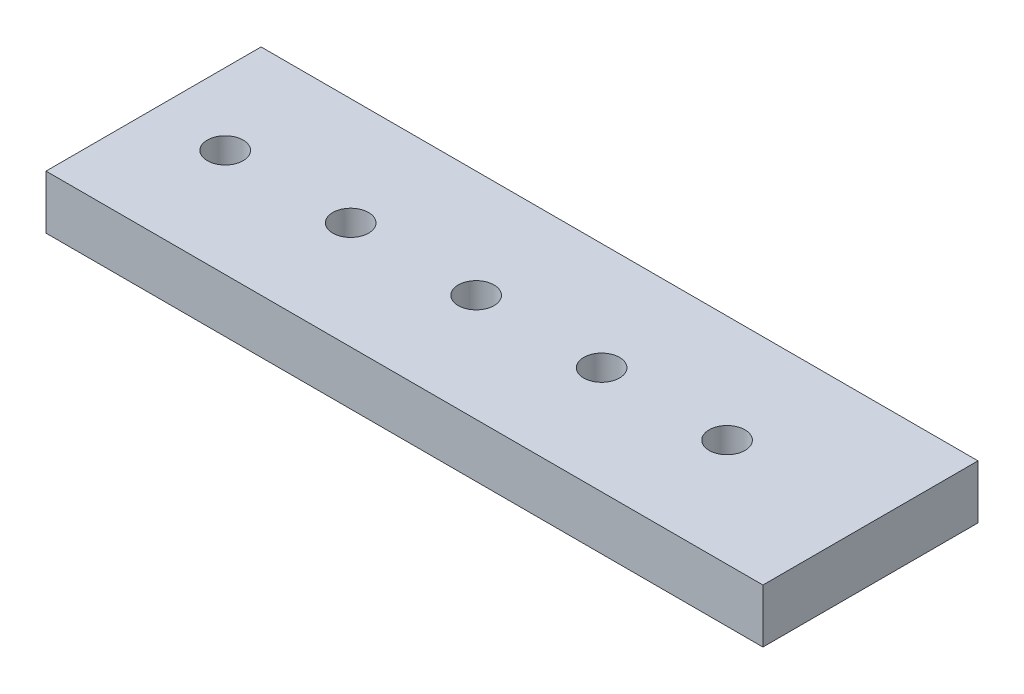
from build123d import *

# Parameters (mm, degrees)
BASESKETCH_W             = 200
BASESKETCH_H             = 60
BASEBOSS_DEPTH           = 15
SEEDHOLESKETCH_R         = 5
SEEDHOLECUT_DEPTH        = 15
HOLESLINEARPATTERN_COUNT = 5
HOLESLINEARPATTERN_PITCH = 35


with BuildPart() as part:
    # BaseSketch → BaseBoss (new body)
    with BuildSketch(Plane(origin=(0, 0, 0), x_dir=(1, 0, 0), z_dir=(0, 1, 0))):
        with Locations((100, 30)):
            Rectangle(BASESKETCH_W, BASESKETCH_H)
    extrude(amount=-BASEBOSS_DEPTH)

    # SeedHoleSketch → SeedHoleCut (cut)
    with BuildSketch(Plane(origin=(0, 0, 0), x_dir=(1, 0, 0), z_dir=(0, 1, 0))):
        with Locations(Location((20, 30, 0), (0, 0, 270))):
            Circle(SEEDHOLESKETCH_R)
    seedholecut = extrude(amount=-SEEDHOLECUT_DEPTH, mode=Mode.SUBTRACT)

    # HolesLinearPattern: SeedHoleCut ×5
    with Locations(*[(i * HOLESLINEARPATTERN_PITCH, 0, 0) for i in range(1, HOLESLINEARPATTERN_COUNT)]):
        add(seedholecut, mode=Mode.SUBTRACT)


solid = part.part
